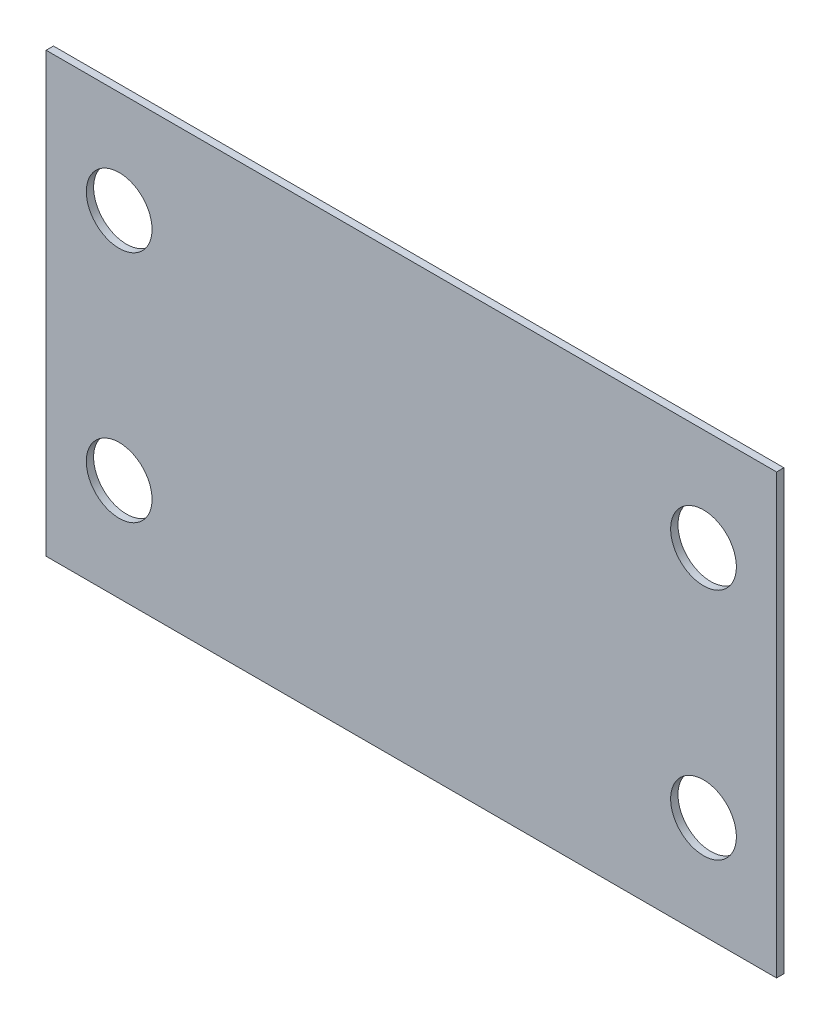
ISO-10303-21;
HEADER;
FILE_DESCRIPTION(('STEP AP214'),'2;1');
FILE_NAME('part.step','',(''),(''),'','','');
FILE_SCHEMA(('AUTOMOTIVE_DESIGN { 1 0 10303 214 1 1 1 1 }'));
ENDSEC;
DATA;
#1=APPLICATION_CONTEXT('core data for automotive mechanical design processes');
#2=APPLICATION_PROTOCOL_DEFINITION('international standard','automotive_design',2000,#1);
#3=PRODUCT_CONTEXT('',#1,'mechanical');
#4=PRODUCT('Part','Part','',(#3));
#5=PRODUCT_RELATED_PRODUCT_CATEGORY('part','',(#4));
#6=PRODUCT_DEFINITION_FORMATION('','',#4);
#7=PRODUCT_DEFINITION_CONTEXT('part definition',#1,'design');
#8=PRODUCT_DEFINITION('design','',#6,#7);
#9=PRODUCT_DEFINITION_SHAPE('','',#8);
#10=(LENGTH_UNIT() NAMED_UNIT(*) SI_UNIT(.MILLI.,.METRE.));
#11=(NAMED_UNIT(*) PLANE_ANGLE_UNIT() SI_UNIT($,.RADIAN.));
#12=(NAMED_UNIT(*) SI_UNIT($,.STERADIAN.) SOLID_ANGLE_UNIT());
#13=UNCERTAINTY_MEASURE_WITH_UNIT(LENGTH_MEASURE(1.E-05),#10,'distance_accuracy_value','');
#14=(GEOMETRIC_REPRESENTATION_CONTEXT(3) GLOBAL_UNCERTAINTY_ASSIGNED_CONTEXT((#13)) GLOBAL_UNIT_ASSIGNED_CONTEXT((#10,
#11,#12)) REPRESENTATION_CONTEXT('',''));
#15=CARTESIAN_POINT('',(0.,0.,0.));
#16=DIRECTION('',(0.,0.,1.));
#17=DIRECTION('',(1.,0.,0.));
#18=AXIS2_PLACEMENT_3D('',#15,#16,#17);
#19=CARTESIAN_POINT('',(-25.,15.,0.5));
#20=DIRECTION('',(0.,0.,1.));
#21=DIRECTION('',(1.,0.,0.));
#22=AXIS2_PLACEMENT_3D('',#19,#20,#21);
#23=PLANE('',#22);
#24=CARTESIAN_POINT('',(-20.,-8.,0.5));
#25=DIRECTION('',(0.,0.,1.));
#26=DIRECTION('',(1.,0.,0.));
#27=AXIS2_PLACEMENT_3D('',#24,#25,#26);
#28=CIRCLE('',#27,2.25);
#29=CARTESIAN_POINT('',(-17.75,-8.,0.5));
#30=VERTEX_POINT('',#29);
#31=EDGE_CURVE('E119',#30,#30,#28,.T.);
#32=ORIENTED_EDGE('',*,*,#31,.F.);
#33=EDGE_LOOP('',(#32));
#34=FACE_BOUND('',#33,.T.);
#35=CARTESIAN_POINT('',(20.,-8.,0.5));
#36=DIRECTION('',(0.,0.,1.));
#37=DIRECTION('',(1.,0.,0.));
#38=AXIS2_PLACEMENT_3D('',#35,#36,#37);
#39=CIRCLE('',#38,2.25);
#40=CARTESIAN_POINT('',(22.25,-8.,0.5));
#41=VERTEX_POINT('',#40);
#42=EDGE_CURVE('E98',#41,#41,#39,.T.);
#43=ORIENTED_EDGE('',*,*,#42,.F.);
#44=EDGE_LOOP('',(#43));
#45=FACE_BOUND('',#44,.T.);
#46=DIRECTION('',(-1.,0.,0.));
#47=VECTOR('',#46,1.);
#48=CARTESIAN_POINT('',(25.,15.,0.5));
#49=LINE('',#48,#47);
#50=CARTESIAN_POINT('',(25.,15.,0.5));
#51=VERTEX_POINT('',#50);
#52=CARTESIAN_POINT('',(-25.,15.,0.5));
#53=VERTEX_POINT('',#52);
#54=EDGE_CURVE('E83',#51,#53,#49,.T.);
#55=ORIENTED_EDGE('',*,*,#54,.T.);
#56=DIRECTION('',(0.,-1.,0.));
#57=VECTOR('',#56,1.);
#58=CARTESIAN_POINT('',(-25.,15.,0.5));
#59=LINE('',#58,#57);
#60=CARTESIAN_POINT('',(-25.,-15.,0.5));
#61=VERTEX_POINT('',#60);
#62=EDGE_CURVE('E78',#53,#61,#59,.T.);
#63=ORIENTED_EDGE('',*,*,#62,.T.);
#64=DIRECTION('',(1.,0.,0.));
#65=VECTOR('',#64,1.);
#66=CARTESIAN_POINT('',(-25.,-15.,0.5));
#67=LINE('',#66,#65);
#68=CARTESIAN_POINT('',(25.,-15.,0.5));
#69=VERTEX_POINT('',#68);
#70=EDGE_CURVE('E81',#61,#69,#67,.T.);
#71=ORIENTED_EDGE('',*,*,#70,.T.);
#72=DIRECTION('',(0.,1.,0.));
#73=VECTOR('',#72,1.);
#74=CARTESIAN_POINT('',(25.,-15.,0.5));
#75=LINE('',#74,#73);
#76=EDGE_CURVE('E48',#69,#51,#75,.T.);
#77=ORIENTED_EDGE('',*,*,#76,.T.);
#78=EDGE_LOOP('',(#55,#63,#71,#77));
#79=FACE_BOUND('',#78,.T.);
#80=CARTESIAN_POINT('',(20.,8.,0.5));
#81=DIRECTION('',(0.,0.,1.));
#82=DIRECTION('',(1.,0.,0.));
#83=AXIS2_PLACEMENT_3D('',#80,#81,#82);
#84=CIRCLE('',#83,2.25);
#85=CARTESIAN_POINT('',(22.25,8.,0.5));
#86=VERTEX_POINT('',#85);
#87=EDGE_CURVE('E113',#86,#86,#84,.T.);
#88=ORIENTED_EDGE('',*,*,#87,.F.);
#89=EDGE_LOOP('',(#88));
#90=FACE_BOUND('',#89,.T.);
#91=CARTESIAN_POINT('',(-20.,8.,0.5));
#92=DIRECTION('',(0.,0.,1.));
#93=DIRECTION('',(1.,0.,0.));
#94=AXIS2_PLACEMENT_3D('',#91,#92,#93);
#95=CIRCLE('',#94,2.25);
#96=CARTESIAN_POINT('',(-17.75,8.,0.5));
#97=VERTEX_POINT('',#96);
#98=EDGE_CURVE('E125',#97,#97,#95,.T.);
#99=ORIENTED_EDGE('',*,*,#98,.F.);
#100=EDGE_LOOP('',(#99));
#101=FACE_BOUND('',#100,.T.);
#102=ADVANCED_FACE('F31',(#34,#45,#79,#90,#101),#23,.T.);
#103=CARTESIAN_POINT('',(-25.,15.,0.));
#104=DIRECTION('',(0.,0.,1.));
#105=DIRECTION('',(1.,0.,0.));
#106=AXIS2_PLACEMENT_3D('',#103,#104,#105);
#107=PLANE('',#106);
#108=CARTESIAN_POINT('',(-20.,-8.,0.));
#109=DIRECTION('',(0.,0.,1.));
#110=DIRECTION('',(1.,0.,0.));
#111=AXIS2_PLACEMENT_3D('',#108,#109,#110);
#112=CIRCLE('',#111,2.25);
#113=CARTESIAN_POINT('',(-17.75,-8.,0.));
#114=VERTEX_POINT('',#113);
#115=EDGE_CURVE('E122',#114,#114,#112,.T.);
#116=ORIENTED_EDGE('',*,*,#115,.T.);
#117=EDGE_LOOP('',(#116));
#118=FACE_BOUND('',#117,.T.);
#119=CARTESIAN_POINT('',(20.,-8.,0.));
#120=DIRECTION('',(0.,0.,1.));
#121=DIRECTION('',(1.,0.,0.));
#122=AXIS2_PLACEMENT_3D('',#119,#120,#121);
#123=CIRCLE('',#122,2.25);
#124=CARTESIAN_POINT('',(22.25,-8.,0.));
#125=VERTEX_POINT('',#124);
#126=EDGE_CURVE('E110',#125,#125,#123,.T.);
#127=ORIENTED_EDGE('',*,*,#126,.T.);
#128=EDGE_LOOP('',(#127));
#129=FACE_BOUND('',#128,.T.);
#130=DIRECTION('',(-1.,0.,0.));
#131=VECTOR('',#130,1.);
#132=CARTESIAN_POINT('',(25.,15.,0.));
#133=LINE('',#132,#131);
#134=CARTESIAN_POINT('',(25.,15.,0.));
#135=VERTEX_POINT('',#134);
#136=CARTESIAN_POINT('',(-25.,15.,0.));
#137=VERTEX_POINT('',#136);
#138=EDGE_CURVE('E95',#135,#137,#133,.T.);
#139=ORIENTED_EDGE('',*,*,#138,.F.);
#140=DIRECTION('',(0.,1.,0.));
#141=VECTOR('',#140,1.);
#142=CARTESIAN_POINT('',(25.,-15.,0.));
#143=LINE('',#142,#141);
#144=CARTESIAN_POINT('',(25.,-15.,0.));
#145=VERTEX_POINT('',#144);
#146=EDGE_CURVE('E71',#145,#135,#143,.T.);
#147=ORIENTED_EDGE('',*,*,#146,.F.);
#148=DIRECTION('',(1.,0.,0.));
#149=VECTOR('',#148,1.);
#150=CARTESIAN_POINT('',(-25.,-15.,0.));
#151=LINE('',#150,#149);
#152=CARTESIAN_POINT('',(-25.,-15.,0.));
#153=VERTEX_POINT('',#152);
#154=EDGE_CURVE('E65',#153,#145,#151,.T.);
#155=ORIENTED_EDGE('',*,*,#154,.F.);
#156=DIRECTION('',(0.,-1.,0.));
#157=VECTOR('',#156,1.);
#158=CARTESIAN_POINT('',(-25.,15.,0.));
#159=LINE('',#158,#157);
#160=EDGE_CURVE('E87',#137,#153,#159,.T.);
#161=ORIENTED_EDGE('',*,*,#160,.F.);
#162=EDGE_LOOP('',(#139,#147,#155,#161));
#163=FACE_BOUND('',#162,.T.);
#164=CARTESIAN_POINT('',(20.,8.,0.));
#165=DIRECTION('',(0.,0.,1.));
#166=DIRECTION('',(1.,0.,0.));
#167=AXIS2_PLACEMENT_3D('',#164,#165,#166);
#168=CIRCLE('',#167,2.25);
#169=CARTESIAN_POINT('',(22.25,8.,0.));
#170=VERTEX_POINT('',#169);
#171=EDGE_CURVE('E116',#170,#170,#168,.T.);
#172=ORIENTED_EDGE('',*,*,#171,.T.);
#173=EDGE_LOOP('',(#172));
#174=FACE_BOUND('',#173,.T.);
#175=CARTESIAN_POINT('',(-20.,8.,0.));
#176=DIRECTION('',(0.,0.,1.));
#177=DIRECTION('',(1.,0.,0.));
#178=AXIS2_PLACEMENT_3D('',#175,#176,#177);
#179=CIRCLE('',#178,2.25);
#180=CARTESIAN_POINT('',(-17.75,8.,0.));
#181=VERTEX_POINT('',#180);
#182=EDGE_CURVE('E128',#181,#181,#179,.T.);
#183=ORIENTED_EDGE('',*,*,#182,.T.);
#184=EDGE_LOOP('',(#183));
#185=FACE_BOUND('',#184,.T.);
#186=ADVANCED_FACE('F106',(#118,#129,#163,#174,#185),#107,.F.);
#187=CARTESIAN_POINT('',(25.,15.,0.5));
#188=DIRECTION('',(0.,-1.,0.));
#189=DIRECTION('',(0.,0.,-1.));
#190=AXIS2_PLACEMENT_3D('',#187,#188,#189);
#191=PLANE('',#190);
#192=ORIENTED_EDGE('',*,*,#138,.T.);
#193=DIRECTION('',(0.,0.,-1.));
#194=VECTOR('',#193,1.);
#195=CARTESIAN_POINT('',(-25.,15.,0.5));
#196=LINE('',#195,#194);
#197=EDGE_CURVE('E11',#53,#137,#196,.T.);
#198=ORIENTED_EDGE('',*,*,#197,.F.);
#199=ORIENTED_EDGE('',*,*,#54,.F.);
#200=DIRECTION('',(0.,0.,-1.));
#201=VECTOR('',#200,1.);
#202=CARTESIAN_POINT('',(25.,15.,0.5));
#203=LINE('',#202,#201);
#204=EDGE_CURVE('E91',#51,#135,#203,.T.);
#205=ORIENTED_EDGE('',*,*,#204,.T.);
#206=EDGE_LOOP('',(#192,#198,#199,#205));
#207=FACE_BOUND('',#206,.T.);
#208=ADVANCED_FACE('F33',(#207),#191,.F.);
#209=CARTESIAN_POINT('',(-25.,15.,0.5));
#210=DIRECTION('',(1.,0.,0.));
#211=DIRECTION('',(0.,0.,-1.));
#212=AXIS2_PLACEMENT_3D('',#209,#210,#211);
#213=PLANE('',#212);
#214=ORIENTED_EDGE('',*,*,#160,.T.);
#215=DIRECTION('',(0.,0.,-1.));
#216=VECTOR('',#215,1.);
#217=CARTESIAN_POINT('',(-25.,-15.,0.5));
#218=LINE('',#217,#216);
#219=EDGE_CURVE('E40',#61,#153,#218,.T.);
#220=ORIENTED_EDGE('',*,*,#219,.F.);
#221=ORIENTED_EDGE('',*,*,#62,.F.);
#222=ORIENTED_EDGE('',*,*,#197,.T.);
#223=EDGE_LOOP('',(#214,#220,#221,#222));
#224=FACE_BOUND('',#223,.T.);
#225=ADVANCED_FACE('F86',(#224),#213,.F.);
#226=CARTESIAN_POINT('',(-25.,-15.,0.5));
#227=DIRECTION('',(0.,1.,0.));
#228=DIRECTION('',(0.,0.,1.));
#229=AXIS2_PLACEMENT_3D('',#226,#227,#228);
#230=PLANE('',#229);
#231=ORIENTED_EDGE('',*,*,#154,.T.);
#232=DIRECTION('',(0.,0.,-1.));
#233=VECTOR('',#232,1.);
#234=CARTESIAN_POINT('',(25.,-15.,0.5));
#235=LINE('',#234,#233);
#236=EDGE_CURVE('E88',#69,#145,#235,.T.);
#237=ORIENTED_EDGE('',*,*,#236,.F.);
#238=ORIENTED_EDGE('',*,*,#70,.F.);
#239=ORIENTED_EDGE('',*,*,#219,.T.);
#240=EDGE_LOOP('',(#231,#237,#238,#239));
#241=FACE_BOUND('',#240,.T.);
#242=ADVANCED_FACE('F89',(#241),#230,.F.);
#243=CARTESIAN_POINT('',(25.,-15.,0.5));
#244=DIRECTION('',(-1.,0.,0.));
#245=DIRECTION('',(0.,0.,1.));
#246=AXIS2_PLACEMENT_3D('',#243,#244,#245);
#247=PLANE('',#246);
#248=ORIENTED_EDGE('',*,*,#146,.T.);
#249=ORIENTED_EDGE('',*,*,#204,.F.);
#250=ORIENTED_EDGE('',*,*,#76,.F.);
#251=ORIENTED_EDGE('',*,*,#236,.T.);
#252=EDGE_LOOP('',(#248,#249,#250,#251));
#253=FACE_BOUND('',#252,.T.);
#254=ADVANCED_FACE('F103',(#253),#247,.F.);
#255=CARTESIAN_POINT('',(20.,-8.,0.5));
#256=DIRECTION('',(0.,0.,-1.));
#257=DIRECTION('',(-1.,0.,0.));
#258=AXIS2_PLACEMENT_3D('',#255,#256,#257);
#259=CYLINDRICAL_SURFACE('',#258,2.25);
#260=ORIENTED_EDGE('',*,*,#42,.T.);
#261=EDGE_LOOP('',(#260));
#262=FACE_BOUND('',#261,.T.);
#263=ORIENTED_EDGE('',*,*,#126,.F.);
#264=EDGE_LOOP('',(#263));
#265=FACE_BOUND('',#264,.T.);
#266=ADVANCED_FACE('F148',(#262,#265),#259,.F.);
#267=CARTESIAN_POINT('',(20.,8.,0.5));
#268=DIRECTION('',(0.,0.,-1.));
#269=DIRECTION('',(-1.,0.,0.));
#270=AXIS2_PLACEMENT_3D('',#267,#268,#269);
#271=CYLINDRICAL_SURFACE('',#270,2.25);
#272=ORIENTED_EDGE('',*,*,#87,.T.);
#273=EDGE_LOOP('',(#272));
#274=FACE_BOUND('',#273,.T.);
#275=ORIENTED_EDGE('',*,*,#171,.F.);
#276=EDGE_LOOP('',(#275));
#277=FACE_BOUND('',#276,.T.);
#278=ADVANCED_FACE('F194',(#274,#277),#271,.F.);
#279=CARTESIAN_POINT('',(-20.,-8.,0.5));
#280=DIRECTION('',(0.,0.,-1.));
#281=DIRECTION('',(-1.,0.,0.));
#282=AXIS2_PLACEMENT_3D('',#279,#280,#281);
#283=CYLINDRICAL_SURFACE('',#282,2.25);
#284=ORIENTED_EDGE('',*,*,#31,.T.);
#285=EDGE_LOOP('',(#284));
#286=FACE_BOUND('',#285,.T.);
#287=ORIENTED_EDGE('',*,*,#115,.F.);
#288=EDGE_LOOP('',(#287));
#289=FACE_BOUND('',#288,.T.);
#290=ADVANCED_FACE('F202',(#286,#289),#283,.F.);
#291=CARTESIAN_POINT('',(-20.,8.,0.5));
#292=DIRECTION('',(0.,0.,-1.));
#293=DIRECTION('',(-1.,0.,0.));
#294=AXIS2_PLACEMENT_3D('',#291,#292,#293);
#295=CYLINDRICAL_SURFACE('',#294,2.25);
#296=ORIENTED_EDGE('',*,*,#98,.T.);
#297=EDGE_LOOP('',(#296));
#298=FACE_BOUND('',#297,.T.);
#299=ORIENTED_EDGE('',*,*,#182,.F.);
#300=EDGE_LOOP('',(#299));
#301=FACE_BOUND('',#300,.T.);
#302=ADVANCED_FACE('F134',(#298,#301),#295,.F.);
#303=CLOSED_SHELL('',(#102,#186,#208,#225,#242,#254,#266,#278,#290,#302));
#304=MANIFOLD_SOLID_BREP('B2',#303);
#305=ADVANCED_BREP_SHAPE_REPRESENTATION('',(#18,#304),#14);
#306=SHAPE_DEFINITION_REPRESENTATION(#9,#305);
ENDSEC;
END-ISO-10303-21;
